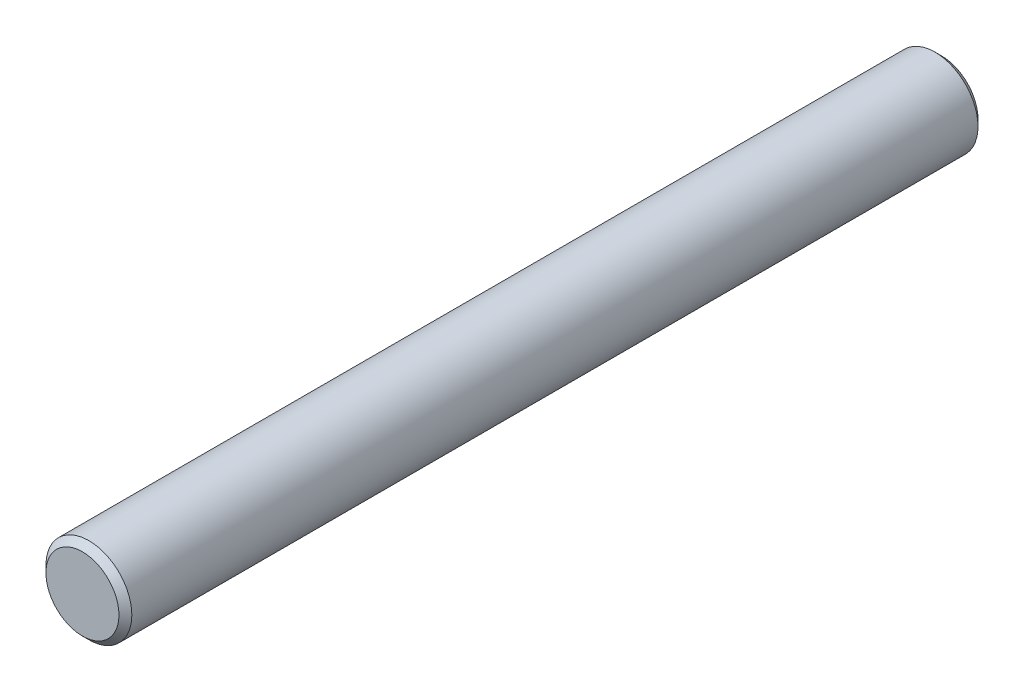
from build123d import *

# Parameters (mm, degrees)
SKETCH_1_R      = 1
EXTRUDE_1_DEPTH = 20
CHAMFER_1_SIZE  = 0.15


with BuildPart() as part:
    # Sketch 1 → Extrude 1 (new body)
    with BuildSketch(Plane.XY):
        Circle(SKETCH_1_R)
    extrude(amount=EXTRUDE_1_DEPTH)

    # Chamfer 1
    chamfer_1_edges = [part.edges().sort_by_distance(p)[0] for p in [
        (-1, 0, 0),
        (-1, 0, 20),
    ]]
    chamfer(chamfer_1_edges, length=CHAMFER_1_SIZE)


solid = part.part
